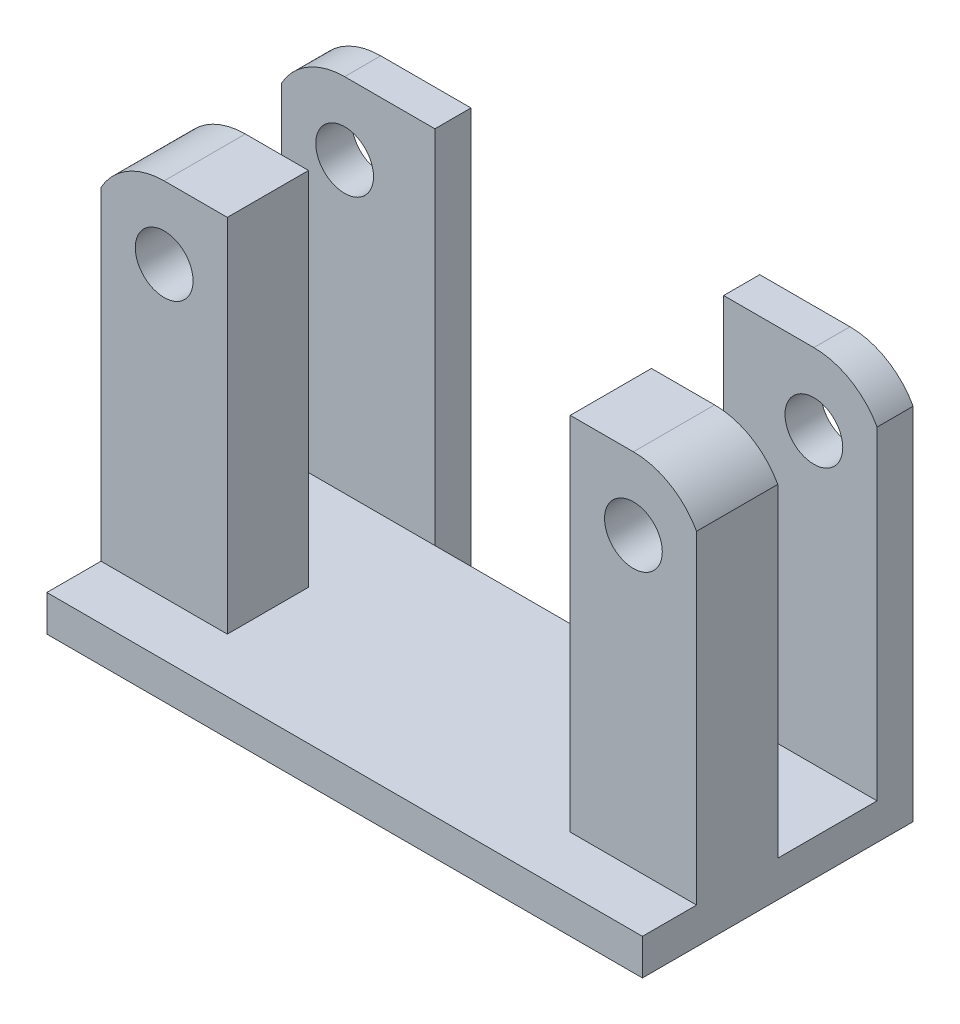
from build123d import *

# Parameters (mm, degrees)
EXTRUDE_1_DEPTH     = 2
SKETCH_1_3_W        = 7
SKETCH_1_3_H        = 4.5
SKETCH_1_3_W_2      = 8.5
SKETCH_1_3_H_2      = 2
EXTRUDE_2_DEPTH     = 20
CUT_EXTRUDE_1_REACH = 54.233
SKETCH_2_R          = 1.6


with BuildPart() as part:
    # Sketch 1 → Extrude 1 (new body)
    with BuildSketch(Plane(origin=(0, 0, 0), x_dir=(1, 0, 0), z_dir=(0, 1, 0))):
        Polygon((-46.736243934, 25.188805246), (-46.736243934, 10.188805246), (-13.736243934, 10.188805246), (-13.736243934, 25.188805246), (-22.236243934, 25.188805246), (-22.236243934, 23.188805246), (-38.236243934, 23.188805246), (-38.236243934, 25.188805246), align=None)
    extrude(amount=-EXTRUDE_1_DEPTH)

    # Sketch 1_3 → Extrude 2 (add)
    with BuildSketch(Plane(origin=(0, 0, 0), x_dir=(1, 0, 0), z_dir=(0, 1, 0))):
        with Locations((-43.236243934, 15.438805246)):
            Rectangle(SKETCH_1_3_W, SKETCH_1_3_H)
        with Locations((-42.486243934, 24.188805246)):
            Rectangle(SKETCH_1_3_W_2, SKETCH_1_3_H_2)
        with Locations((-17.986243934, 24.188805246)):
            Rectangle(SKETCH_1_3_W_2, SKETCH_1_3_H_2)
        with Locations((-17.236243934, 15.438805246)):
            Rectangle(SKETCH_1_3_W, SKETCH_1_3_H)
    extrude(amount=EXTRUDE_2_DEPTH)

    # Cut-Extrude 1: up to this face of the body (flat: up to its plane)
    cut_extrude_1_end = Plane(part.part.faces().sort_by_distance((-42.486243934, 9, -25.188805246))[0])
    # Sketch 2 → Cut-Extrude 1 (cut, up to the picked face)
    with BuildSketch(Plane.XY.offset(-13.188805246), mode=Mode.PRIVATE) as cut_extrude_1_sk1:
        with BuildLine():
            Line((-46.736243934, 20), (-46.736243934, 17.936491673))
            ThreePointArc((-46.736243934, 17.936491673), (-45.267749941, 19.445719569), (-43.236243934, 20))
            Line((-43.236243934, 20), (-46.736243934, 20))
        make_face()
    cut_extrude_1_tool1 = split(extrude(cut_extrude_1_sk1.sketch, amount=-CUT_EXTRUDE_1_REACH, mode=Mode.PRIVATE), bisect_by=cut_extrude_1_end, keep=Keep.BOTH, mode=Mode.PRIVATE)
    # Sketch 2 → Cut-Extrude 1 (cut, up to the picked face)
    with BuildSketch(Plane.XY.offset(-13.188805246), mode=Mode.PRIVATE) as cut_extrude_1_sk2:
        with BuildLine():
            ThreePointArc((-17.236243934, 20), (-15.204737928, 19.445719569), (-13.736243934, 17.936491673))
            Line((-13.736243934, 17.936491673), (-13.736243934, 20))
            Line((-13.736243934, 20), (-17.236243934, 20))
        make_face()
    cut_extrude_1_tool2 = split(extrude(cut_extrude_1_sk2.sketch, amount=-CUT_EXTRUDE_1_REACH, mode=Mode.PRIVATE), bisect_by=cut_extrude_1_end, keep=Keep.BOTH, mode=Mode.PRIVATE)
    # Sketch 2 → Cut-Extrude 1 (cut, up to the picked face)
    with BuildSketch(Plane.XY.offset(-13.188805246), mode=Mode.PRIVATE) as cut_extrude_1_sk3:
        with Locations((-43.236243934, 16)):
            Circle(SKETCH_2_R)
    cut_extrude_1_tool3 = split(extrude(cut_extrude_1_sk3.sketch, amount=-CUT_EXTRUDE_1_REACH, mode=Mode.PRIVATE), bisect_by=cut_extrude_1_end, keep=Keep.BOTH, mode=Mode.PRIVATE)
    # Sketch 2 → Cut-Extrude 1 (cut, up to the picked face)
    with BuildSketch(Plane.XY.offset(-13.188805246), mode=Mode.PRIVATE) as cut_extrude_1_sk4:
        with Locations((-17.236243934, 16)):
            Circle(SKETCH_2_R)
    cut_extrude_1_tool4 = split(extrude(cut_extrude_1_sk4.sketch, amount=-CUT_EXTRUDE_1_REACH, mode=Mode.PRIVATE), bisect_by=cut_extrude_1_end, keep=Keep.BOTH, mode=Mode.PRIVATE)
    add(cut_extrude_1_tool1.solids().sort_by(Axis((-45.91259, 19.422903, -13.188805), (0, 0, -1)))[0], mode=Mode.SUBTRACT)
    add(cut_extrude_1_tool2.solids().sort_by(Axis((-14.559898, 19.422903, -13.188805), (0, 0, -1)))[0], mode=Mode.SUBTRACT)
    add(cut_extrude_1_tool3.solids().sort_by(Axis((-43.236244, 16, -13.188805), (0, 0, -1)))[0], mode=Mode.SUBTRACT)
    add(cut_extrude_1_tool4.solids().sort_by(Axis((-17.236244, 16, -13.188805), (0, 0, -1)))[0], mode=Mode.SUBTRACT)


solid = part.part
